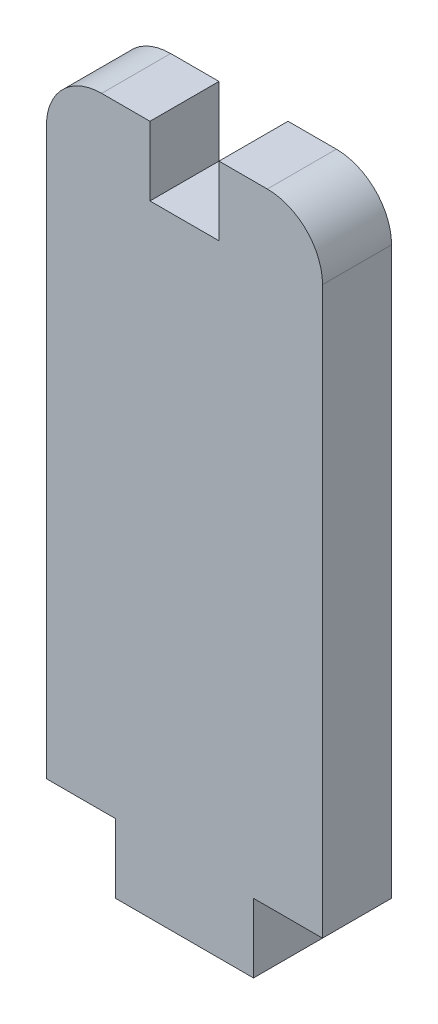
from build123d import *

# Parameters (mm, degrees)
SKETCH1_W           = 12.7
SKETCH1_H           = 31.75
BOSS_EXTRUDE1_DEPTH = 1.5875
SKETCH2_W           = 3.175
SKETCH2_H           = 3.175
CUT_EXTRUDE1_DEPTH  = 18.390191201
SKETCH3_W           = 3.175
SKETCH3_H           = 3.175
CUT_EXTRUDE2_DEPTH  = 18.390191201
FILLET1_R           = 2.54


with BuildPart() as part:
    # Sketch1 → Boss-Extrude1 (new, symmetric)
    with BuildSketch(Plane.XY):
        Rectangle(SKETCH1_W, SKETCH1_H)
    extrude(amount=BOSS_EXTRUDE1_DEPTH, both=True)

    # Sketch2 → Cut-Extrude1 (cut, through all)
    with BuildSketch(Plane.XY.offset(1.5875)):
        with Locations((-4.7625, -14.2875)):
            Rectangle(SKETCH2_W, SKETCH2_H)
        with Locations((4.7625, -14.2875)):
            Rectangle(SKETCH2_W, SKETCH2_H)
    extrude(amount=-CUT_EXTRUDE1_DEPTH, mode=Mode.SUBTRACT)

    # Sketch3 → Cut-Extrude2 (cut, through all)
    with BuildSketch(Plane.XY.offset(1.5875)):
        with Locations((0, 14.2875)):
            Rectangle(SKETCH3_W, SKETCH3_H)
    extrude(amount=-CUT_EXTRUDE2_DEPTH, mode=Mode.SUBTRACT)

    # Fillet1
    fillet1_edges = [part.edges().sort_by_distance(p)[0] for p in [
        (-6.35, 15.875, 0),
        (6.35, 15.875, 0),
    ]]
    fillet(fillet1_edges, radius=FILLET1_R)


solid = part.part
